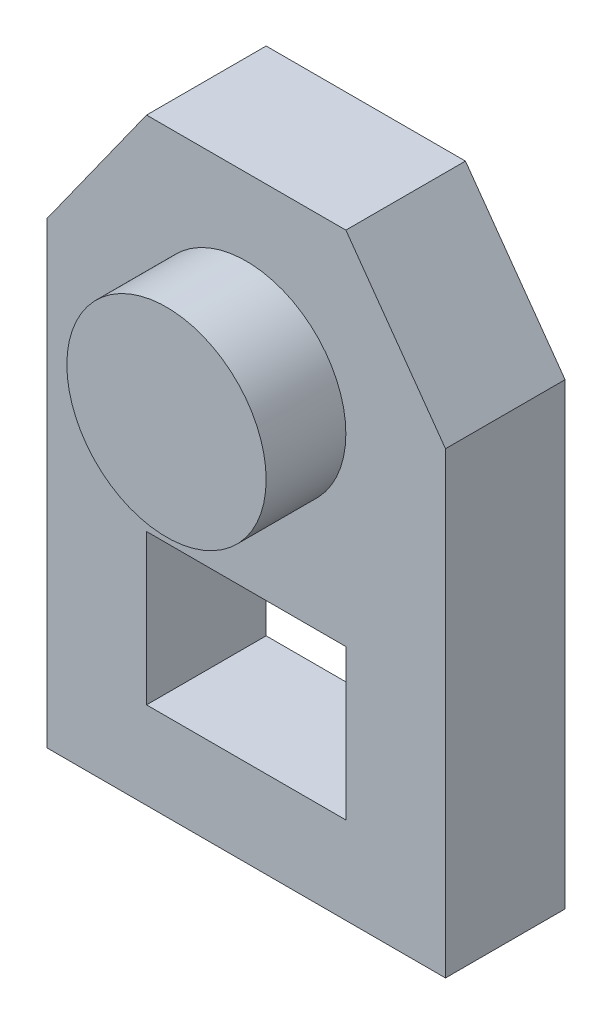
from build123d import *

# Parameters (mm, degrees)
EXTRUDE_1_DEPTH     = 12
SKETCH_2_R          = 10
EXTRUDE_2_DEPTH     = 8
SKETCH_3_W          = 20
SKETCH_3_H          = 15.067909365
CUT_EXTRUDE_1_DEPTH = 18


with BuildPart() as part:
    # Sketch 1 → Extrude 1 (new body)
    with BuildSketch(Plane.XY):
        Polygon((10, 60), (-10, 60), (-20, 46), (-20, 0), (20, 0), (20, 46), align=None)
    extrude(amount=EXTRUDE_1_DEPTH)

    # Sketch 2 → Extrude 2 (add)
    with BuildSketch(Plane.XY.offset(12)):
        with Locations((0, 42.311460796)):
            Circle(SKETCH_2_R)
    extrude(amount=EXTRUDE_2_DEPTH)

    # Sketch 3 → Cut-Extrude 1 (cut)
    with BuildSketch(Plane.XY.offset(12)):
        with Locations((0, 16.27128186)):
            Rectangle(SKETCH_3_W, SKETCH_3_H)
    extrude(amount=-CUT_EXTRUDE_1_DEPTH, mode=Mode.SUBTRACT)


solid = part.part
